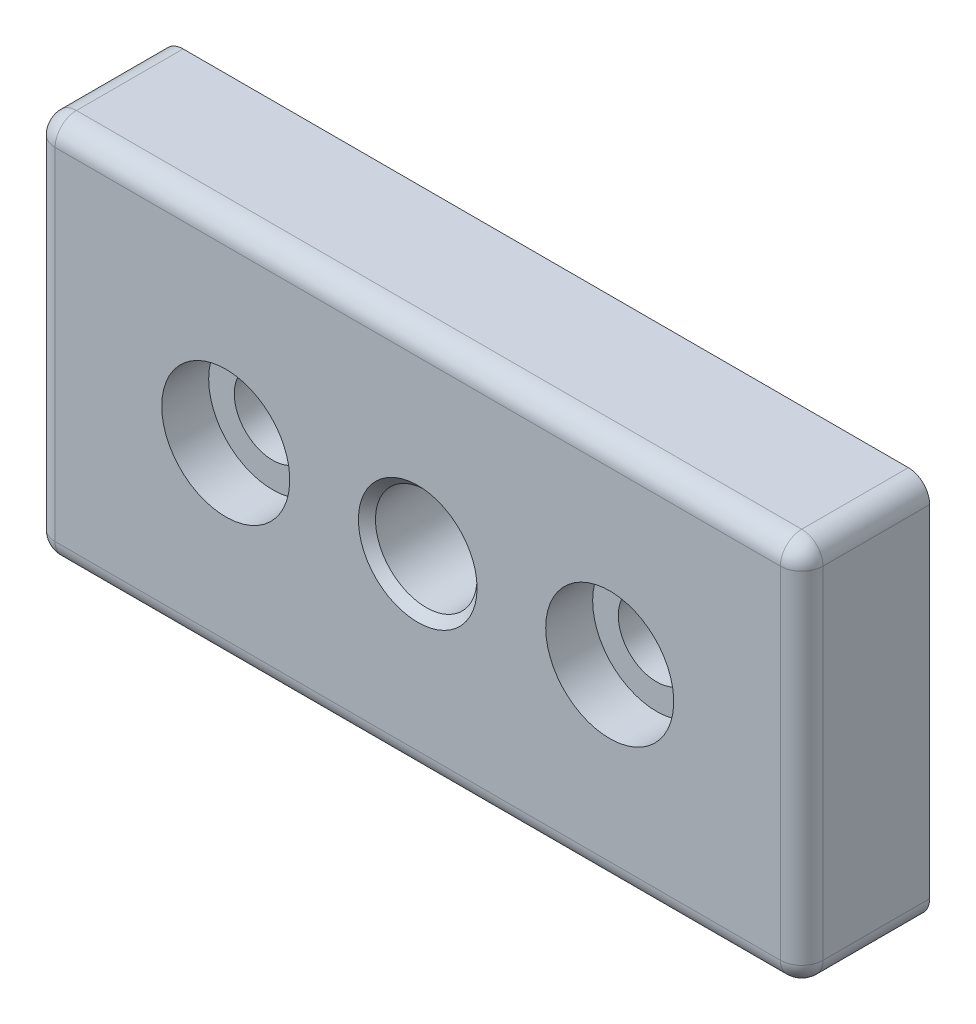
ISO-10303-21;
HEADER;
FILE_DESCRIPTION(('STEP AP214'),'2;1');
FILE_NAME('part.step','',(''),(''),'','','');
FILE_SCHEMA(('AUTOMOTIVE_DESIGN { 1 0 10303 214 1 1 1 1 }'));
ENDSEC;
DATA;
#1=APPLICATION_CONTEXT('core data for automotive mechanical design processes');
#2=APPLICATION_PROTOCOL_DEFINITION('international standard','automotive_design',2000,#1);
#3=PRODUCT_CONTEXT('',#1,'mechanical');
#4=PRODUCT('Part','Part','',(#3));
#5=PRODUCT_RELATED_PRODUCT_CATEGORY('part','',(#4));
#6=PRODUCT_DEFINITION_FORMATION('','',#4);
#7=PRODUCT_DEFINITION_CONTEXT('part definition',#1,'design');
#8=PRODUCT_DEFINITION('design','',#6,#7);
#9=PRODUCT_DEFINITION_SHAPE('','',#8);
#10=(LENGTH_UNIT() NAMED_UNIT(*) SI_UNIT(.MILLI.,.METRE.));
#11=(NAMED_UNIT(*) PLANE_ANGLE_UNIT() SI_UNIT($,.RADIAN.));
#12=(NAMED_UNIT(*) SI_UNIT($,.STERADIAN.) SOLID_ANGLE_UNIT());
#13=UNCERTAINTY_MEASURE_WITH_UNIT(LENGTH_MEASURE(1.E-05),#10,'distance_accuracy_value','');
#14=(GEOMETRIC_REPRESENTATION_CONTEXT(3) GLOBAL_UNCERTAINTY_ASSIGNED_CONTEXT((#13)) GLOBAL_UNIT_ASSIGNED_CONTEXT((#10,
#11,#12)) REPRESENTATION_CONTEXT('',''));
#15=CARTESIAN_POINT('',(0.,0.,0.));
#16=DIRECTION('',(0.,0.,1.));
#17=DIRECTION('',(1.,0.,0.));
#18=AXIS2_PLACEMENT_3D('',#15,#16,#17);
#19=CARTESIAN_POINT('',(0.,0.,15.0000000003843));
#20=DIRECTION('',(0.,0.,1.));
#21=DIRECTION('',(1.,0.,0.));
#22=AXIS2_PLACEMENT_3D('',#19,#20,#21);
#23=CONICAL_SURFACE('',#22,6.95312499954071,0.785398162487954);
#24=CARTESIAN_POINT('',(0.,0.,15.0000000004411));
#25=DIRECTION('',(0.,0.,1.));
#26=DIRECTION('',(1.,0.,0.));
#27=AXIS2_PLACEMENT_3D('',#24,#25,#26);
#28=CIRCLE('',#27,6.95312499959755);
#29=CARTESIAN_POINT('',(6.95312499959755,0.,15.0000000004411));
#30=VERTEX_POINT('',#29);
#31=EDGE_CURVE('E19',#30,#30,#28,.F.);
#32=ORIENTED_EDGE('',*,*,#31,.F.);
#33=EDGE_LOOP('',(#32));
#34=FACE_BOUND('',#33,.T.);
#35=CARTESIAN_POINT('',(0.,0.,14.));
#36=DIRECTION('',(0.,0.,1.));
#37=DIRECTION('',(1.,0.,0.));
#38=AXIS2_PLACEMENT_3D('',#35,#36,#37);
#39=CIRCLE('',#38,5.953125);
#40=CARTESIAN_POINT('',(5.953125,0.,14.));
#41=VERTEX_POINT('',#40);
#42=EDGE_CURVE('E118',#41,#41,#39,.F.);
#43=ORIENTED_EDGE('',*,*,#42,.T.);
#44=EDGE_LOOP('',(#43));
#45=FACE_BOUND('',#44,.T.);
#46=ADVANCED_FACE('F15',(#34,#45),#23,.F.);
#47=CARTESIAN_POINT('',(0.,0.,15.));
#48=DIRECTION('',(0.,0.,1.));
#49=DIRECTION('',(1.,0.,0.));
#50=AXIS2_PLACEMENT_3D('',#47,#48,#49);
#51=PLANE('',#50);
#52=ORIENTED_EDGE('',*,*,#31,.T.);
#53=EDGE_LOOP('',(#52));
#54=FACE_BOUND('',#53,.T.);
#55=CARTESIAN_POINT('',(-22.5,0.,15.));
#56=DIRECTION('',(0.,0.,-1.));
#57=DIRECTION('',(-1.,0.,0.));
#58=AXIS2_PLACEMENT_3D('',#55,#56,#57);
#59=CIRCLE('',#58,7.5);
#60=CARTESIAN_POINT('',(-30.,0.,15.));
#61=VERTEX_POINT('',#60);
#62=EDGE_CURVE('E116',#61,#61,#59,.T.);
#63=ORIENTED_EDGE('',*,*,#62,.T.);
#64=EDGE_LOOP('',(#63));
#65=FACE_BOUND('',#64,.T.);
#66=CARTESIAN_POINT('',(22.5,0.,15.));
#67=DIRECTION('',(0.,0.,-1.));
#68=DIRECTION('',(-1.,0.,0.));
#69=AXIS2_PLACEMENT_3D('',#66,#67,#68);
#70=CIRCLE('',#69,7.5);
#71=CARTESIAN_POINT('',(15.,0.,15.));
#72=VERTEX_POINT('',#71);
#73=EDGE_CURVE('E113',#72,#72,#70,.T.);
#74=ORIENTED_EDGE('',*,*,#73,.T.);
#75=EDGE_LOOP('',(#74));
#76=FACE_BOUND('',#75,.T.);
#77=DIRECTION('',(-1.,0.,0.));
#78=VECTOR('',#77,1.);
#79=CARTESIAN_POINT('',(22.5,-20.,15.));
#80=LINE('',#79,#78);
#81=CARTESIAN_POINT('',(42.5,-20.0000000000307,15.));
#82=VERTEX_POINT('',#81);
#83=CARTESIAN_POINT('',(-42.5,-20.,15.));
#84=VERTEX_POINT('',#83);
#85=EDGE_CURVE('E139',#82,#84,#80,.T.);
#86=ORIENTED_EDGE('',*,*,#85,.F.);
#87=DIRECTION('',(0.,-1.,0.));
#88=VECTOR('',#87,1.);
#89=CARTESIAN_POINT('',(42.5,11.25,15.));
#90=LINE('',#89,#88);
#91=CARTESIAN_POINT('',(42.5,20.,15.));
#92=VERTEX_POINT('',#91);
#93=EDGE_CURVE('E132',#92,#82,#90,.T.);
#94=ORIENTED_EDGE('',*,*,#93,.F.);
#95=DIRECTION('',(1.,0.,0.));
#96=VECTOR('',#95,1.);
#97=CARTESIAN_POINT('',(-22.5,20.,15.));
#98=LINE('',#97,#96);
#99=CARTESIAN_POINT('',(-42.5,20.0000000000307,15.));
#100=VERTEX_POINT('',#99);
#101=EDGE_CURVE('E115',#100,#92,#98,.T.);
#102=ORIENTED_EDGE('',*,*,#101,.F.);
#103=DIRECTION('',(0.,1.,0.));
#104=VECTOR('',#103,1.);
#105=CARTESIAN_POINT('',(-42.5,-11.25,15.));
#106=LINE('',#105,#104);
#107=EDGE_CURVE('E144',#84,#100,#106,.T.);
#108=ORIENTED_EDGE('',*,*,#107,.F.);
#109=EDGE_LOOP('',(#86,#94,#102,#108));
#110=FACE_BOUND('',#109,.T.);
#111=ADVANCED_FACE('F280',(#54,#65,#76,#110),#51,.T.);
#112=CARTESIAN_POINT('',(0.,0.,0.));
#113=DIRECTION('',(0.,0.,1.));
#114=DIRECTION('',(1.,0.,0.));
#115=AXIS2_PLACEMENT_3D('',#112,#113,#114);
#116=CYLINDRICAL_SURFACE('',#115,5.953125);
#117=ORIENTED_EDGE('',*,*,#42,.F.);
#118=EDGE_LOOP('',(#117));
#119=FACE_BOUND('',#118,.T.);
#120=CARTESIAN_POINT('',(0.,0.,0.));
#121=DIRECTION('',(0.,0.,1.));
#122=DIRECTION('',(1.,0.,0.));
#123=AXIS2_PLACEMENT_3D('',#120,#121,#122);
#124=CIRCLE('',#123,5.953125);
#125=CARTESIAN_POINT('',(5.953125,0.,0.));
#126=VERTEX_POINT('',#125);
#127=EDGE_CURVE('E109',#126,#126,#124,.F.);
#128=ORIENTED_EDGE('',*,*,#127,.T.);
#129=EDGE_LOOP('',(#128));
#130=FACE_BOUND('',#129,.T.);
#131=ADVANCED_FACE('F276',(#119,#130),#116,.F.);
#132=CARTESIAN_POINT('',(-22.5,0.,15.));
#133=DIRECTION('',(0.,0.,-1.));
#134=DIRECTION('',(-1.,0.,0.));
#135=AXIS2_PLACEMENT_3D('',#132,#133,#134);
#136=CYLINDRICAL_SURFACE('',#135,7.5);
#137=CARTESIAN_POINT('',(-22.5,0.,9.5));
#138=DIRECTION('',(0.,0.,-1.));
#139=DIRECTION('',(-1.,0.,0.));
#140=AXIS2_PLACEMENT_3D('',#137,#138,#139);
#141=CIRCLE('',#140,7.5);
#142=CARTESIAN_POINT('',(-30.,0.,9.5));
#143=VERTEX_POINT('',#142);
#144=EDGE_CURVE('E106',#143,#143,#141,.T.);
#145=ORIENTED_EDGE('',*,*,#144,.T.);
#146=EDGE_LOOP('',(#145));
#147=FACE_BOUND('',#146,.T.);
#148=ORIENTED_EDGE('',*,*,#62,.F.);
#149=EDGE_LOOP('',(#148));
#150=FACE_BOUND('',#149,.T.);
#151=ADVANCED_FACE('F279',(#147,#150),#136,.F.);
#152=CARTESIAN_POINT('',(22.5,0.,15.));
#153=DIRECTION('',(0.,0.,-1.));
#154=DIRECTION('',(-1.,0.,0.));
#155=AXIS2_PLACEMENT_3D('',#152,#153,#154);
#156=CYLINDRICAL_SURFACE('',#155,7.5);
#157=CARTESIAN_POINT('',(22.5,0.,9.5));
#158=DIRECTION('',(0.,0.,-1.));
#159=DIRECTION('',(-1.,0.,0.));
#160=AXIS2_PLACEMENT_3D('',#157,#158,#159);
#161=CIRCLE('',#160,7.5);
#162=CARTESIAN_POINT('',(15.,0.,9.5));
#163=VERTEX_POINT('',#162);
#164=EDGE_CURVE('E102',#163,#163,#161,.T.);
#165=ORIENTED_EDGE('',*,*,#164,.T.);
#166=EDGE_LOOP('',(#165));
#167=FACE_BOUND('',#166,.T.);
#168=ORIENTED_EDGE('',*,*,#73,.F.);
#169=EDGE_LOOP('',(#168));
#170=FACE_BOUND('',#169,.T.);
#171=ADVANCED_FACE('F274',(#167,#170),#156,.F.);
#172=CARTESIAN_POINT('',(-22.5,20.,12.5));
#173=DIRECTION('',(1.,0.,0.));
#174=DIRECTION('',(0.,1.,0.));
#175=AXIS2_PLACEMENT_3D('',#172,#173,#174);
#176=CYLINDRICAL_SURFACE('',#175,2.5);
#177=CARTESIAN_POINT('',(-42.5,20.,12.5));
#178=DIRECTION('',(1.,0.,0.));
#179=DIRECTION('',(0.,1.,0.));
#180=AXIS2_PLACEMENT_3D('',#177,#178,#179);
#181=CIRCLE('',#180,2.5);
#182=CARTESIAN_POINT('',(-42.5,22.5,12.5));
#183=VERTEX_POINT('',#182);
#184=EDGE_CURVE('E128',#100,#183,#181,.F.);
#185=ORIENTED_EDGE('',*,*,#184,.F.);
#186=ORIENTED_EDGE('',*,*,#101,.T.);
#187=CARTESIAN_POINT('',(42.5,20.,12.5));
#188=DIRECTION('',(1.,0.,0.));
#189=DIRECTION('',(0.,1.,0.));
#190=AXIS2_PLACEMENT_3D('',#187,#188,#189);
#191=CIRCLE('',#190,2.5);
#192=CARTESIAN_POINT('',(42.5,22.5,12.5));
#193=VERTEX_POINT('',#192);
#194=EDGE_CURVE('E135',#193,#92,#191,.T.);
#195=ORIENTED_EDGE('',*,*,#194,.F.);
#196=DIRECTION('',(1.,0.,0.));
#197=VECTOR('',#196,1.);
#198=CARTESIAN_POINT('',(-45.,22.5,12.5));
#199=LINE('',#198,#197);
#200=EDGE_CURVE('E105',#183,#193,#199,.T.);
#201=ORIENTED_EDGE('',*,*,#200,.F.);
#202=EDGE_LOOP('',(#185,#186,#195,#201));
#203=FACE_BOUND('',#202,.T.);
#204=ADVANCED_FACE('F270',(#203),#176,.T.);
#205=CARTESIAN_POINT('',(-42.5,20.,12.5));
#206=DIRECTION('',(1.,0.,0.));
#207=DIRECTION('',(0.,1.,0.));
#208=AXIS2_PLACEMENT_3D('',#205,#206,#207);
#209=SPHERICAL_SURFACE('',#208,2.5);
#210=ORIENTED_EDGE('',*,*,#184,.T.);
#211=CARTESIAN_POINT('',(-42.5,20.,12.5));
#212=DIRECTION('',(0.,0.,1.));
#213=DIRECTION('',(1.,0.,0.));
#214=AXIS2_PLACEMENT_3D('',#211,#212,#213);
#215=CIRCLE('',#214,2.5);
#216=CARTESIAN_POINT('',(-45.,20.,12.5));
#217=VERTEX_POINT('',#216);
#218=EDGE_CURVE('E228',#217,#183,#215,.F.);
#219=ORIENTED_EDGE('',*,*,#218,.F.);
#220=CARTESIAN_POINT('',(-42.5,20.,12.5));
#221=DIRECTION('',(0.,1.,0.));
#222=DIRECTION('',(-1.,0.,0.));
#223=AXIS2_PLACEMENT_3D('',#220,#221,#222);
#224=CIRCLE('',#223,2.5);
#225=EDGE_CURVE('E147',#100,#217,#224,.F.);
#226=ORIENTED_EDGE('',*,*,#225,.F.);
#227=EDGE_LOOP('',(#210,#219,#226));
#228=FACE_BOUND('',#227,.T.);
#229=ADVANCED_FACE('F267',(#228),#209,.T.);
#230=CARTESIAN_POINT('',(-42.5,-11.25,12.5));
#231=DIRECTION('',(0.,1.,0.));
#232=DIRECTION('',(-1.,0.,0.));
#233=AXIS2_PLACEMENT_3D('',#230,#231,#232);
#234=CYLINDRICAL_SURFACE('',#233,2.5);
#235=CARTESIAN_POINT('',(-42.5,-20.,12.5));
#236=DIRECTION('',(0.,-1.,0.));
#237=DIRECTION('',(1.,0.,0.));
#238=AXIS2_PLACEMENT_3D('',#235,#236,#237);
#239=CIRCLE('',#238,2.5);
#240=CARTESIAN_POINT('',(-45.,-20.,12.5));
#241=VERTEX_POINT('',#240);
#242=EDGE_CURVE('E146',#84,#241,#239,.T.);
#243=ORIENTED_EDGE('',*,*,#242,.F.);
#244=ORIENTED_EDGE('',*,*,#107,.T.);
#245=ORIENTED_EDGE('',*,*,#225,.T.);
#246=DIRECTION('',(0.,1.,0.));
#247=VECTOR('',#246,1.);
#248=CARTESIAN_POINT('',(-45.,-22.5,12.5));
#249=LINE('',#248,#247);
#250=EDGE_CURVE('E74',#241,#217,#249,.T.);
#251=ORIENTED_EDGE('',*,*,#250,.F.);
#252=EDGE_LOOP('',(#243,#244,#245,#251));
#253=FACE_BOUND('',#252,.T.);
#254=ADVANCED_FACE('F255',(#253),#234,.T.);
#255=CARTESIAN_POINT('',(-42.5,-20.,12.5));
#256=DIRECTION('',(1.,0.,0.));
#257=DIRECTION('',(0.,1.,0.));
#258=AXIS2_PLACEMENT_3D('',#255,#256,#257);
#259=SPHERICAL_SURFACE('',#258,2.5);
#260=ORIENTED_EDGE('',*,*,#242,.T.);
#261=CARTESIAN_POINT('',(-42.5,-20.,12.5));
#262=DIRECTION('',(0.,0.,1.));
#263=DIRECTION('',(1.,0.,0.));
#264=AXIS2_PLACEMENT_3D('',#261,#262,#263);
#265=CIRCLE('',#264,2.5);
#266=CARTESIAN_POINT('',(-42.5,-22.5,12.5));
#267=VERTEX_POINT('',#266);
#268=EDGE_CURVE('E456',#267,#241,#265,.F.);
#269=ORIENTED_EDGE('',*,*,#268,.F.);
#270=CARTESIAN_POINT('',(-42.5,-20.,12.5));
#271=DIRECTION('',(-1.,0.,0.));
#272=DIRECTION('',(0.,0.,1.));
#273=AXIS2_PLACEMENT_3D('',#270,#271,#272);
#274=CIRCLE('',#273,2.5);
#275=EDGE_CURVE('E143',#84,#267,#274,.F.);
#276=ORIENTED_EDGE('',*,*,#275,.F.);
#277=EDGE_LOOP('',(#260,#269,#276));
#278=FACE_BOUND('',#277,.T.);
#279=ADVANCED_FACE('F250',(#278),#259,.T.);
#280=CARTESIAN_POINT('',(22.5,-20.,12.5));
#281=DIRECTION('',(-1.,0.,0.));
#282=DIRECTION('',(0.,0.,1.));
#283=AXIS2_PLACEMENT_3D('',#280,#281,#282);
#284=CYLINDRICAL_SURFACE('',#283,2.5);
#285=CARTESIAN_POINT('',(42.5,-20.,12.5));
#286=DIRECTION('',(1.,0.,0.));
#287=DIRECTION('',(0.,1.,0.));
#288=AXIS2_PLACEMENT_3D('',#285,#286,#287);
#289=CIRCLE('',#288,2.5);
#290=CARTESIAN_POINT('',(42.5,-22.5,12.5));
#291=VERTEX_POINT('',#290);
#292=EDGE_CURVE('E142',#82,#291,#289,.T.);
#293=ORIENTED_EDGE('',*,*,#292,.F.);
#294=ORIENTED_EDGE('',*,*,#85,.T.);
#295=ORIENTED_EDGE('',*,*,#275,.T.);
#296=DIRECTION('',(1.,0.,0.));
#297=VECTOR('',#296,1.);
#298=CARTESIAN_POINT('',(45.,-22.5,12.5));
#299=LINE('',#298,#297);
#300=EDGE_CURVE('E236',#291,#267,#299,.F.);
#301=ORIENTED_EDGE('',*,*,#300,.F.);
#302=EDGE_LOOP('',(#293,#294,#295,#301));
#303=FACE_BOUND('',#302,.T.);
#304=ADVANCED_FACE('F246',(#303),#284,.T.);
#305=CARTESIAN_POINT('',(42.5,-20.,12.5));
#306=DIRECTION('',(1.,0.,0.));
#307=DIRECTION('',(0.,1.,0.));
#308=AXIS2_PLACEMENT_3D('',#305,#306,#307);
#309=SPHERICAL_SURFACE('',#308,2.5);
#310=CARTESIAN_POINT('',(42.5,-20.,12.5));
#311=DIRECTION('',(0.,-1.,0.));
#312=DIRECTION('',(1.,0.,0.));
#313=AXIS2_PLACEMENT_3D('',#310,#311,#312);
#314=CIRCLE('',#313,2.5);
#315=CARTESIAN_POINT('',(45.,-20.,12.5));
#316=VERTEX_POINT('',#315);
#317=EDGE_CURVE('E136',#82,#316,#314,.F.);
#318=ORIENTED_EDGE('',*,*,#317,.F.);
#319=ORIENTED_EDGE('',*,*,#292,.T.);
#320=CARTESIAN_POINT('',(42.5,-20.,12.5));
#321=DIRECTION('',(0.,0.,1.));
#322=DIRECTION('',(1.,0.,0.));
#323=AXIS2_PLACEMENT_3D('',#320,#321,#322);
#324=CIRCLE('',#323,2.5);
#325=EDGE_CURVE('E229',#316,#291,#324,.F.);
#326=ORIENTED_EDGE('',*,*,#325,.F.);
#327=EDGE_LOOP('',(#318,#319,#326));
#328=FACE_BOUND('',#327,.T.);
#329=ADVANCED_FACE('F243',(#328),#309,.T.);
#330=CARTESIAN_POINT('',(42.5,11.25,12.5));
#331=DIRECTION('',(0.,-1.,0.));
#332=DIRECTION('',(1.,0.,0.));
#333=AXIS2_PLACEMENT_3D('',#330,#331,#332);
#334=CYLINDRICAL_SURFACE('',#333,2.5);
#335=CARTESIAN_POINT('',(42.5,20.,12.5));
#336=DIRECTION('',(0.,-1.,0.));
#337=DIRECTION('',(1.,0.,0.));
#338=AXIS2_PLACEMENT_3D('',#335,#336,#337);
#339=CIRCLE('',#338,2.5);
#340=CARTESIAN_POINT('',(45.,20.,12.5));
#341=VERTEX_POINT('',#340);
#342=EDGE_CURVE('E112',#92,#341,#339,.F.);
#343=ORIENTED_EDGE('',*,*,#342,.F.);
#344=ORIENTED_EDGE('',*,*,#93,.T.);
#345=ORIENTED_EDGE('',*,*,#317,.T.);
#346=DIRECTION('',(0.,1.,0.));
#347=VECTOR('',#346,1.);
#348=CARTESIAN_POINT('',(45.,22.5,12.5));
#349=LINE('',#348,#347);
#350=EDGE_CURVE('E462',#341,#316,#349,.F.);
#351=ORIENTED_EDGE('',*,*,#350,.F.);
#352=EDGE_LOOP('',(#343,#344,#345,#351));
#353=FACE_BOUND('',#352,.T.);
#354=ADVANCED_FACE('F214',(#353),#334,.T.);
#355=CARTESIAN_POINT('',(42.5,20.,12.5));
#356=DIRECTION('',(1.,0.,0.));
#357=DIRECTION('',(0.,1.,0.));
#358=AXIS2_PLACEMENT_3D('',#355,#356,#357);
#359=SPHERICAL_SURFACE('',#358,2.5);
#360=ORIENTED_EDGE('',*,*,#194,.T.);
#361=ORIENTED_EDGE('',*,*,#342,.T.);
#362=CARTESIAN_POINT('',(42.5,20.,12.5));
#363=DIRECTION('',(0.,0.,1.));
#364=DIRECTION('',(1.,0.,0.));
#365=AXIS2_PLACEMENT_3D('',#362,#363,#364);
#366=CIRCLE('',#365,2.5);
#367=EDGE_CURVE('E220',#193,#341,#366,.F.);
#368=ORIENTED_EDGE('',*,*,#367,.F.);
#369=EDGE_LOOP('',(#360,#361,#368));
#370=FACE_BOUND('',#369,.T.);
#371=ADVANCED_FACE('F209',(#370),#359,.T.);
#372=CARTESIAN_POINT('',(0.,0.,0.));
#373=DIRECTION('',(0.,0.,1.));
#374=DIRECTION('',(1.,0.,0.));
#375=AXIS2_PLACEMENT_3D('',#372,#373,#374);
#376=PLANE('',#375);
#377=ORIENTED_EDGE('',*,*,#127,.F.);
#378=EDGE_LOOP('',(#377));
#379=FACE_BOUND('',#378,.T.);
#380=CARTESIAN_POINT('',(0.,0.,0.));
#381=DIRECTION('',(0.,0.,-1.));
#382=DIRECTION('',(-1.,0.,0.));
#383=AXIS2_PLACEMENT_3D('',#380,#381,#382);
#384=CIRCLE('',#383,8.3);
#385=CARTESIAN_POINT('',(-8.3,0.,0.));
#386=VERTEX_POINT('',#385);
#387=EDGE_CURVE('E99',#386,#386,#384,.T.);
#388=ORIENTED_EDGE('',*,*,#387,.T.);
#389=EDGE_LOOP('',(#388));
#390=FACE_BOUND('',#389,.T.);
#391=ADVANCED_FACE('F205',(#379,#390),#376,.F.);
#392=CARTESIAN_POINT('',(-30.15,7.65,9.5));
#393=DIRECTION('',(0.,0.,-1.));
#394=DIRECTION('',(1.,0.,0.));
#395=AXIS2_PLACEMENT_3D('',#392,#393,#394);
#396=PLANE('',#395);
#397=CARTESIAN_POINT('',(-22.5,0.,9.5));
#398=DIRECTION('',(0.,0.,1.));
#399=DIRECTION('',(1.,0.,0.));
#400=AXIS2_PLACEMENT_3D('',#397,#398,#399);
#401=CIRCLE('',#400,4.5);
#402=CARTESIAN_POINT('',(-18.,0.,9.5));
#403=VERTEX_POINT('',#402);
#404=EDGE_CURVE('E96',#403,#403,#401,.F.);
#405=ORIENTED_EDGE('',*,*,#404,.T.);
#406=EDGE_LOOP('',(#405));
#407=FACE_BOUND('',#406,.T.);
#408=ORIENTED_EDGE('',*,*,#144,.F.);
#409=EDGE_LOOP('',(#408));
#410=FACE_BOUND('',#409,.T.);
#411=ADVANCED_FACE('F208',(#407,#410),#396,.F.);
#412=CARTESIAN_POINT('',(14.85,7.65,9.5));
#413=DIRECTION('',(0.,0.,-1.));
#414=DIRECTION('',(1.,0.,0.));
#415=AXIS2_PLACEMENT_3D('',#412,#413,#414);
#416=PLANE('',#415);
#417=CARTESIAN_POINT('',(22.5,0.,9.5));
#418=DIRECTION('',(0.,0.,1.));
#419=DIRECTION('',(1.,0.,0.));
#420=AXIS2_PLACEMENT_3D('',#417,#418,#419);
#421=CIRCLE('',#420,4.5);
#422=CARTESIAN_POINT('',(27.,0.,9.5));
#423=VERTEX_POINT('',#422);
#424=EDGE_CURVE('E89',#423,#423,#421,.F.);
#425=ORIENTED_EDGE('',*,*,#424,.T.);
#426=EDGE_LOOP('',(#425));
#427=FACE_BOUND('',#426,.T.);
#428=ORIENTED_EDGE('',*,*,#164,.F.);
#429=EDGE_LOOP('',(#428));
#430=FACE_BOUND('',#429,.T.);
#431=ADVANCED_FACE('F17',(#427,#430),#416,.F.);
#432=CARTESIAN_POINT('',(-45.,22.5,0.));
#433=DIRECTION('',(0.,1.,0.));
#434=DIRECTION('',(0.,0.,1.));
#435=AXIS2_PLACEMENT_3D('',#432,#433,#434);
#436=PLANE('',#435);
#437=DIRECTION('',(0.,0.,1.));
#438=VECTOR('',#437,1.);
#439=CARTESIAN_POINT('',(-42.5,22.5,0.));
#440=LINE('',#439,#438);
#441=CARTESIAN_POINT('',(-42.5,22.5,0.));
#442=VERTEX_POINT('',#441);
#443=EDGE_CURVE('E60',#183,#442,#440,.F.);
#444=ORIENTED_EDGE('',*,*,#443,.F.);
#445=ORIENTED_EDGE('',*,*,#200,.T.);
#446=DIRECTION('',(0.,0.,1.));
#447=VECTOR('',#446,1.);
#448=CARTESIAN_POINT('',(42.5,22.5,0.));
#449=LINE('',#448,#447);
#450=CARTESIAN_POINT('',(42.5,22.5,0.));
#451=VERTEX_POINT('',#450);
#452=EDGE_CURVE('E468',#451,#193,#449,.T.);
#453=ORIENTED_EDGE('',*,*,#452,.F.);
#454=DIRECTION('',(1.,0.,0.));
#455=VECTOR('',#454,1.);
#456=CARTESIAN_POINT('',(0.,22.5,0.));
#457=LINE('',#456,#455);
#458=EDGE_CURVE('E87',#451,#442,#457,.F.);
#459=ORIENTED_EDGE('',*,*,#458,.T.);
#460=EDGE_LOOP('',(#444,#445,#453,#459));
#461=FACE_BOUND('',#460,.T.);
#462=ADVANCED_FACE('F201',(#461),#436,.T.);
#463=CARTESIAN_POINT('',(-42.5,20.,0.));
#464=DIRECTION('',(0.,0.,1.));
#465=DIRECTION('',(1.,0.,0.));
#466=AXIS2_PLACEMENT_3D('',#463,#464,#465);
#467=CYLINDRICAL_SURFACE('',#466,2.5);
#468=ORIENTED_EDGE('',*,*,#218,.T.);
#469=ORIENTED_EDGE('',*,*,#443,.T.);
#470=CARTESIAN_POINT('',(-42.5,20.,0.));
#471=DIRECTION('',(0.,0.,1.));
#472=DIRECTION('',(1.,0.,0.));
#473=AXIS2_PLACEMENT_3D('',#470,#471,#472);
#474=CIRCLE('',#473,2.5);
#475=CARTESIAN_POINT('',(-45.,20.,0.));
#476=VERTEX_POINT('',#475);
#477=EDGE_CURVE('E80',#442,#476,#474,.T.);
#478=ORIENTED_EDGE('',*,*,#477,.T.);
#479=DIRECTION('',(0.,0.,1.));
#480=VECTOR('',#479,1.);
#481=CARTESIAN_POINT('',(-45.,20.,0.));
#482=LINE('',#481,#480);
#483=EDGE_CURVE('E67',#217,#476,#482,.F.);
#484=ORIENTED_EDGE('',*,*,#483,.F.);
#485=EDGE_LOOP('',(#468,#469,#478,#484));
#486=FACE_BOUND('',#485,.T.);
#487=ADVANCED_FACE('F86',(#486),#467,.T.);
#488=CARTESIAN_POINT('',(-45.,-22.5,0.));
#489=DIRECTION('',(-1.,0.,0.));
#490=DIRECTION('',(0.,0.,1.));
#491=AXIS2_PLACEMENT_3D('',#488,#489,#490);
#492=PLANE('',#491);
#493=DIRECTION('',(0.,0.,1.));
#494=VECTOR('',#493,1.);
#495=CARTESIAN_POINT('',(-45.,-20.,0.));
#496=LINE('',#495,#494);
#497=CARTESIAN_POINT('',(-45.,-20.,0.));
#498=VERTEX_POINT('',#497);
#499=EDGE_CURVE('E239',#241,#498,#496,.F.);
#500=ORIENTED_EDGE('',*,*,#499,.F.);
#501=ORIENTED_EDGE('',*,*,#250,.T.);
#502=ORIENTED_EDGE('',*,*,#483,.T.);
#503=DIRECTION('',(0.,1.,0.));
#504=VECTOR('',#503,1.);
#505=CARTESIAN_POINT('',(-45.,0.,0.));
#506=LINE('',#505,#504);
#507=EDGE_CURVE('E71',#476,#498,#506,.F.);
#508=ORIENTED_EDGE('',*,*,#507,.T.);
#509=EDGE_LOOP('',(#500,#501,#502,#508));
#510=FACE_BOUND('',#509,.T.);
#511=ADVANCED_FACE('F70',(#510),#492,.T.);
#512=CARTESIAN_POINT('',(-42.5,-20.,0.));
#513=DIRECTION('',(0.,0.,1.));
#514=DIRECTION('',(1.,0.,0.));
#515=AXIS2_PLACEMENT_3D('',#512,#513,#514);
#516=CYLINDRICAL_SURFACE('',#515,2.5);
#517=ORIENTED_EDGE('',*,*,#268,.T.);
#518=ORIENTED_EDGE('',*,*,#499,.T.);
#519=CARTESIAN_POINT('',(-42.5,-20.,0.));
#520=DIRECTION('',(0.,0.,1.));
#521=DIRECTION('',(1.,0.,0.));
#522=AXIS2_PLACEMENT_3D('',#519,#520,#521);
#523=CIRCLE('',#522,2.5);
#524=CARTESIAN_POINT('',(-42.5,-22.5,0.));
#525=VERTEX_POINT('',#524);
#526=EDGE_CURVE('E84',#498,#525,#523,.T.);
#527=ORIENTED_EDGE('',*,*,#526,.T.);
#528=DIRECTION('',(0.,0.,-1.));
#529=VECTOR('',#528,1.);
#530=CARTESIAN_POINT('',(-42.5,-22.5,0.));
#531=LINE('',#530,#529);
#532=EDGE_CURVE('E233',#267,#525,#531,.T.);
#533=ORIENTED_EDGE('',*,*,#532,.F.);
#534=EDGE_LOOP('',(#517,#518,#527,#533));
#535=FACE_BOUND('',#534,.T.);
#536=ADVANCED_FACE('F193',(#535),#516,.T.);
#537=CARTESIAN_POINT('',(45.,-22.5,0.));
#538=DIRECTION('',(0.,-1.,0.));
#539=DIRECTION('',(0.,0.,-1.));
#540=AXIS2_PLACEMENT_3D('',#537,#538,#539);
#541=PLANE('',#540);
#542=ORIENTED_EDGE('',*,*,#532,.T.);
#543=DIRECTION('',(1.,0.,0.));
#544=VECTOR('',#543,1.);
#545=CARTESIAN_POINT('',(0.,-22.5,0.));
#546=LINE('',#545,#544);
#547=CARTESIAN_POINT('',(42.5,-22.5,0.));
#548=VERTEX_POINT('',#547);
#549=EDGE_CURVE('E158',#525,#548,#546,.T.);
#550=ORIENTED_EDGE('',*,*,#549,.T.);
#551=DIRECTION('',(0.,0.,1.));
#552=VECTOR('',#551,1.);
#553=CARTESIAN_POINT('',(42.5,-22.5,0.));
#554=LINE('',#553,#552);
#555=EDGE_CURVE('E232',#291,#548,#554,.F.);
#556=ORIENTED_EDGE('',*,*,#555,.F.);
#557=ORIENTED_EDGE('',*,*,#300,.T.);
#558=EDGE_LOOP('',(#542,#550,#556,#557));
#559=FACE_BOUND('',#558,.T.);
#560=ADVANCED_FACE('F190',(#559),#541,.T.);
#561=CARTESIAN_POINT('',(42.5,-20.,0.));
#562=DIRECTION('',(0.,0.,1.));
#563=DIRECTION('',(1.,0.,0.));
#564=AXIS2_PLACEMENT_3D('',#561,#562,#563);
#565=CYLINDRICAL_SURFACE('',#564,2.5);
#566=ORIENTED_EDGE('',*,*,#325,.T.);
#567=ORIENTED_EDGE('',*,*,#555,.T.);
#568=CARTESIAN_POINT('',(42.5,-20.,0.));
#569=DIRECTION('',(0.,0.,1.));
#570=DIRECTION('',(1.,0.,0.));
#571=AXIS2_PLACEMENT_3D('',#568,#569,#570);
#572=CIRCLE('',#571,2.5);
#573=CARTESIAN_POINT('',(45.,-20.,0.));
#574=VERTEX_POINT('',#573);
#575=EDGE_CURVE('E156',#548,#574,#572,.T.);
#576=ORIENTED_EDGE('',*,*,#575,.T.);
#577=DIRECTION('',(0.,0.,-1.));
#578=VECTOR('',#577,1.);
#579=CARTESIAN_POINT('',(45.,-20.,0.));
#580=LINE('',#579,#578);
#581=EDGE_CURVE('E464',#316,#574,#580,.T.);
#582=ORIENTED_EDGE('',*,*,#581,.F.);
#583=EDGE_LOOP('',(#566,#567,#576,#582));
#584=FACE_BOUND('',#583,.T.);
#585=ADVANCED_FACE('F186',(#584),#565,.T.);
#586=CARTESIAN_POINT('',(45.,22.5,0.));
#587=DIRECTION('',(1.,0.,0.));
#588=DIRECTION('',(0.,0.,-1.));
#589=AXIS2_PLACEMENT_3D('',#586,#587,#588);
#590=PLANE('',#589);
#591=ORIENTED_EDGE('',*,*,#581,.T.);
#592=DIRECTION('',(0.,1.,0.));
#593=VECTOR('',#592,1.);
#594=CARTESIAN_POINT('',(45.,0.,0.));
#595=LINE('',#594,#593);
#596=CARTESIAN_POINT('',(45.,20.,0.));
#597=VERTEX_POINT('',#596);
#598=EDGE_CURVE('E155',#574,#597,#595,.T.);
#599=ORIENTED_EDGE('',*,*,#598,.T.);
#600=DIRECTION('',(0.,0.,1.));
#601=VECTOR('',#600,1.);
#602=CARTESIAN_POINT('',(45.,20.,0.));
#603=LINE('',#602,#601);
#604=EDGE_CURVE('E34',#341,#597,#603,.F.);
#605=ORIENTED_EDGE('',*,*,#604,.F.);
#606=ORIENTED_EDGE('',*,*,#350,.T.);
#607=EDGE_LOOP('',(#591,#599,#605,#606));
#608=FACE_BOUND('',#607,.T.);
#609=ADVANCED_FACE('F183',(#608),#590,.T.);
#610=CARTESIAN_POINT('',(42.5,20.,0.));
#611=DIRECTION('',(0.,0.,1.));
#612=DIRECTION('',(1.,0.,0.));
#613=AXIS2_PLACEMENT_3D('',#610,#611,#612);
#614=CYLINDRICAL_SURFACE('',#613,2.5);
#615=ORIENTED_EDGE('',*,*,#367,.T.);
#616=ORIENTED_EDGE('',*,*,#604,.T.);
#617=CARTESIAN_POINT('',(42.5,20.,0.));
#618=DIRECTION('',(0.,0.,1.));
#619=DIRECTION('',(1.,0.,0.));
#620=AXIS2_PLACEMENT_3D('',#617,#618,#619);
#621=CIRCLE('',#620,2.5);
#622=EDGE_CURVE('E154',#597,#451,#621,.T.);
#623=ORIENTED_EDGE('',*,*,#622,.T.);
#624=ORIENTED_EDGE('',*,*,#452,.T.);
#625=EDGE_LOOP('',(#615,#616,#623,#624));
#626=FACE_BOUND('',#625,.T.);
#627=ADVANCED_FACE('F178',(#626),#614,.T.);
#628=CARTESIAN_POINT('',(0.,0.,0.));
#629=DIRECTION('',(0.,0.,-1.));
#630=DIRECTION('',(-1.,0.,0.));
#631=AXIS2_PLACEMENT_3D('',#628,#629,#630);
#632=TOROIDAL_SURFACE('',#631,9.5,1.2);
#633=CARTESIAN_POINT('',(0.,0.,0.));
#634=DIRECTION('',(0.,0.,-1.));
#635=DIRECTION('',(-1.,0.,0.));
#636=AXIS2_PLACEMENT_3D('',#633,#634,#635);
#637=CIRCLE('',#636,10.7);
#638=CARTESIAN_POINT('',(-10.7,0.,0.));
#639=VERTEX_POINT('',#638);
#640=EDGE_CURVE('E151',#639,#639,#637,.T.);
#641=ORIENTED_EDGE('',*,*,#640,.T.);
#642=EDGE_LOOP('',(#641));
#643=FACE_BOUND('',#642,.T.);
#644=ORIENTED_EDGE('',*,*,#387,.F.);
#645=EDGE_LOOP('',(#644));
#646=FACE_BOUND('',#645,.T.);
#647=ADVANCED_FACE('F173',(#643,#646),#632,.F.);
#648=CARTESIAN_POINT('',(-22.5,0.,0.));
#649=DIRECTION('',(0.,0.,1.));
#650=DIRECTION('',(1.,0.,0.));
#651=AXIS2_PLACEMENT_3D('',#648,#649,#650);
#652=CYLINDRICAL_SURFACE('',#651,4.5);
#653=CARTESIAN_POINT('',(-22.5,0.,0.));
#654=DIRECTION('',(0.,0.,1.));
#655=DIRECTION('',(1.,0.,0.));
#656=AXIS2_PLACEMENT_3D('',#653,#654,#655);
#657=CIRCLE('',#656,4.5);
#658=CARTESIAN_POINT('',(-18.,0.,0.));
#659=VERTEX_POINT('',#658);
#660=EDGE_CURVE('E25',#659,#659,#657,.F.);
#661=ORIENTED_EDGE('',*,*,#660,.T.);
#662=EDGE_LOOP('',(#661));
#663=FACE_BOUND('',#662,.T.);
#664=ORIENTED_EDGE('',*,*,#404,.F.);
#665=EDGE_LOOP('',(#664));
#666=FACE_BOUND('',#665,.T.);
#667=ADVANCED_FACE('F177',(#663,#666),#652,.F.);
#668=CARTESIAN_POINT('',(22.5,0.,0.));
#669=DIRECTION('',(0.,0.,1.));
#670=DIRECTION('',(1.,0.,0.));
#671=AXIS2_PLACEMENT_3D('',#668,#669,#670);
#672=CYLINDRICAL_SURFACE('',#671,4.5);
#673=CARTESIAN_POINT('',(22.5,0.,0.));
#674=DIRECTION('',(0.,0.,1.));
#675=DIRECTION('',(1.,0.,0.));
#676=AXIS2_PLACEMENT_3D('',#673,#674,#675);
#677=CIRCLE('',#676,4.5);
#678=CARTESIAN_POINT('',(27.,0.,0.));
#679=VERTEX_POINT('',#678);
#680=EDGE_CURVE('E10',#679,#679,#677,.F.);
#681=ORIENTED_EDGE('',*,*,#680,.T.);
#682=EDGE_LOOP('',(#681));
#683=FACE_BOUND('',#682,.T.);
#684=ORIENTED_EDGE('',*,*,#424,.F.);
#685=EDGE_LOOP('',(#684));
#686=FACE_BOUND('',#685,.T.);
#687=ADVANCED_FACE('F302',(#683,#686),#672,.F.);
#688=CARTESIAN_POINT('',(0.,0.,0.));
#689=DIRECTION('',(0.,0.,1.));
#690=DIRECTION('',(1.,0.,0.));
#691=AXIS2_PLACEMENT_3D('',#688,#689,#690);
#692=PLANE('',#691);
#693=ORIENTED_EDGE('',*,*,#680,.F.);
#694=EDGE_LOOP('',(#693));
#695=FACE_BOUND('',#694,.T.);
#696=ORIENTED_EDGE('',*,*,#660,.F.);
#697=EDGE_LOOP('',(#696));
#698=FACE_BOUND('',#697,.T.);
#699=ORIENTED_EDGE('',*,*,#640,.F.);
#700=EDGE_LOOP('',(#699));
#701=FACE_BOUND('',#700,.T.);
#702=ORIENTED_EDGE('',*,*,#598,.F.);
#703=ORIENTED_EDGE('',*,*,#575,.F.);
#704=ORIENTED_EDGE('',*,*,#549,.F.);
#705=ORIENTED_EDGE('',*,*,#526,.F.);
#706=ORIENTED_EDGE('',*,*,#507,.F.);
#707=ORIENTED_EDGE('',*,*,#477,.F.);
#708=ORIENTED_EDGE('',*,*,#458,.F.);
#709=ORIENTED_EDGE('',*,*,#622,.F.);
#710=EDGE_LOOP('',(#702,#703,#704,#705,#706,#707,#708,#709));
#711=FACE_BOUND('',#710,.T.);
#712=ADVANCED_FACE('F79',(#695,#698,#701,#711),#692,.F.);
#713=CLOSED_SHELL('',(#46,#111,#131,#151,#171,#204,#229,#254,#279,#304,#329,#354,#371,#391,#411,
#431,#462,#487,#511,#536,#560,#585,#609,#627,#647,#667,#687,#712));
#714=MANIFOLD_SOLID_BREP('B1',#713);
#715=ADVANCED_BREP_SHAPE_REPRESENTATION('',(#18,#714),#14);
#716=SHAPE_DEFINITION_REPRESENTATION(#9,#715);
ENDSEC;
END-ISO-10303-21;
